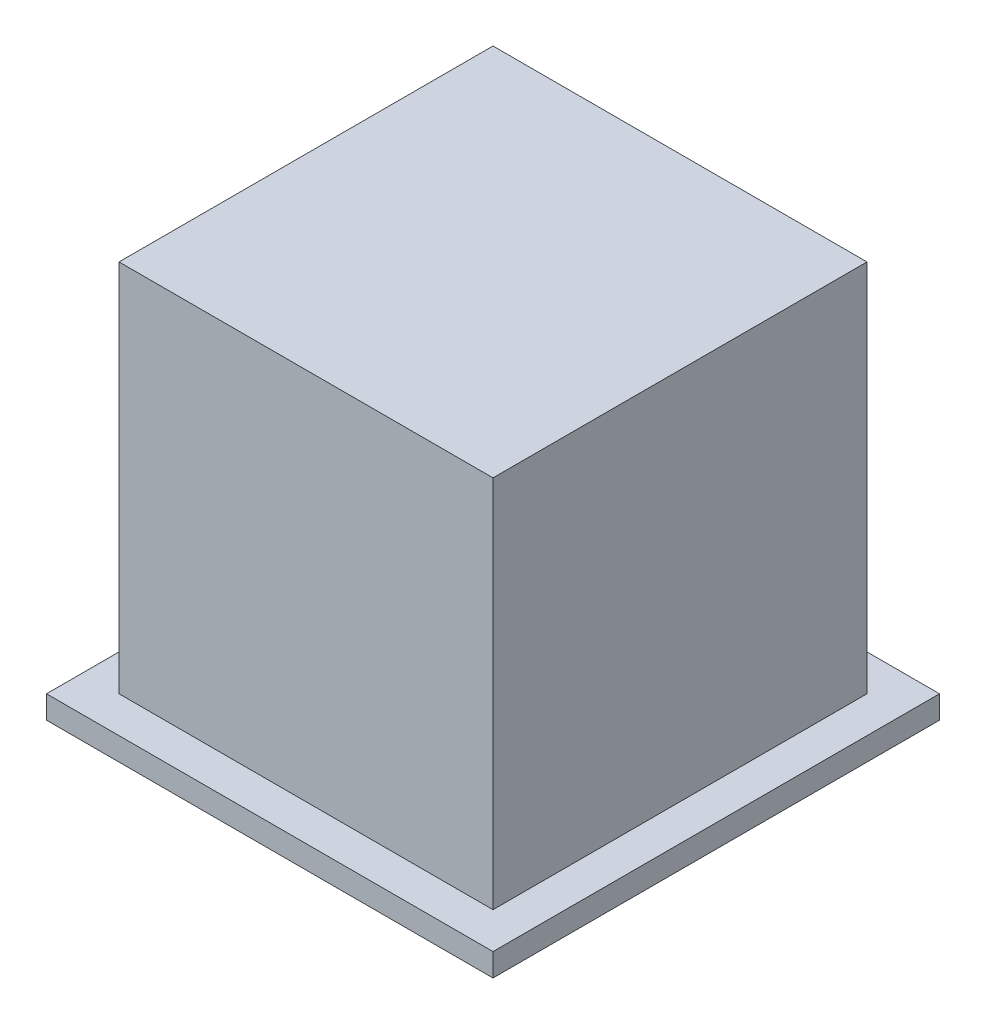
from build123d import *

# Parameters (mm, degrees)
SKETCH1_W           = 49
SKETCH1_H           = 49
SKETCH1_W_2         = 43
SKETCH1_H_2         = 43
BOSS_EXTRUDE1_DEPTH = 49
SKETCH2_W           = 49
SKETCH2_H           = 49
BOSS_EXTRUDE2_DEPTH = 3
SKETCH3_W           = 58.5
SKETCH3_H           = 58.5
SKETCH3_W_2         = 49
SKETCH3_H_2         = 49
BOSS_EXTRUDE3_DEPTH = 3
SKETCH4_W           = 11
SKETCH4_H           = 6
CUT_EXTRUDE1_DEPTH  = 6.58
SKETCH5_W           = 11
SKETCH5_H           = 43
CUT_EXTRUDE2_DEPTH  = 10.71


with BuildPart() as part:
    # Sketch1 → Boss-Extrude1 (new body)
    with BuildSketch(Plane(origin=(0, 0, 0), x_dir=(1, 0, 0), z_dir=(0, 1, 0))):
        Rectangle(SKETCH1_W, SKETCH1_H)
        Rectangle(SKETCH1_W_2, SKETCH1_H_2, mode=Mode.SUBTRACT)
    extrude(amount=BOSS_EXTRUDE1_DEPTH)

    # Sketch2 → Boss-Extrude2 (add)
    with BuildSketch(Plane(origin=(0, 49, 0), x_dir=(1, 0, 0), z_dir=(0, 1, 0))):
        Rectangle(SKETCH2_W, SKETCH2_H)
    extrude(amount=BOSS_EXTRUDE2_DEPTH)

    # Sketch3 → Boss-Extrude3 (add)
    with BuildSketch(Plane.XZ):
        Rectangle(SKETCH3_W, SKETCH3_H)
        Rectangle(SKETCH3_W_2, SKETCH3_H_2, mode=Mode.SUBTRACT)
    extrude(amount=-BOSS_EXTRUDE3_DEPTH)

    # Sketch4 → Cut-Extrude1 (cut)
    with BuildSketch(Plane(origin=(0, 0, -24.5), x_dir=(-1, 0, 0), z_dir=(0, 0, -1))):
        with Locations((0, 46)):
            Rectangle(SKETCH4_W, SKETCH4_H)
    extrude(amount=-CUT_EXTRUDE1_DEPTH, mode=Mode.SUBTRACT)

    # Sketch5 → Cut-Extrude2 (cut)
    with BuildSketch(Plane.XY.offset(-21.5)):
        with Locations((0, 21.5)):
            Rectangle(SKETCH5_W, SKETCH5_H)
    extrude(amount=-CUT_EXTRUDE2_DEPTH, mode=Mode.SUBTRACT)


solid = part.part
